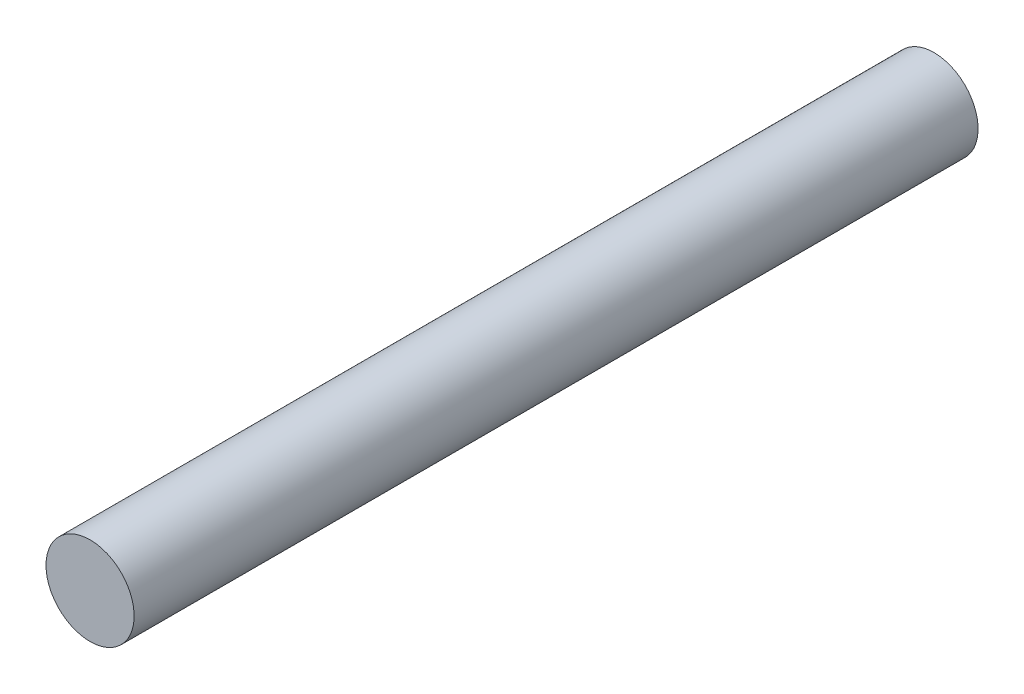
ISO-10303-21;
HEADER;
FILE_DESCRIPTION(('STEP AP214'),'2;1');
FILE_NAME('part.step','',(''),(''),'','','');
FILE_SCHEMA(('AUTOMOTIVE_DESIGN { 1 0 10303 214 1 1 1 1 }'));
ENDSEC;
DATA;
#1=APPLICATION_CONTEXT('core data for automotive mechanical design processes');
#2=APPLICATION_PROTOCOL_DEFINITION('international standard','automotive_design',2000,#1);
#3=PRODUCT_CONTEXT('',#1,'mechanical');
#4=PRODUCT('Part','Part','',(#3));
#5=PRODUCT_RELATED_PRODUCT_CATEGORY('part','',(#4));
#6=PRODUCT_DEFINITION_FORMATION('','',#4);
#7=PRODUCT_DEFINITION_CONTEXT('part definition',#1,'design');
#8=PRODUCT_DEFINITION('design','',#6,#7);
#9=PRODUCT_DEFINITION_SHAPE('','',#8);
#10=(LENGTH_UNIT() NAMED_UNIT(*) SI_UNIT(.MILLI.,.METRE.));
#11=(NAMED_UNIT(*) PLANE_ANGLE_UNIT() SI_UNIT($,.RADIAN.));
#12=(NAMED_UNIT(*) SI_UNIT($,.STERADIAN.) SOLID_ANGLE_UNIT());
#13=UNCERTAINTY_MEASURE_WITH_UNIT(LENGTH_MEASURE(1.E-05),#10,'distance_accuracy_value','');
#14=(GEOMETRIC_REPRESENTATION_CONTEXT(3) GLOBAL_UNCERTAINTY_ASSIGNED_CONTEXT((#13)) GLOBAL_UNIT_ASSIGNED_CONTEXT((#10,
#11,#12)) REPRESENTATION_CONTEXT('',''));
#15=CARTESIAN_POINT('',(0.,0.,0.));
#16=DIRECTION('',(0.,0.,1.));
#17=DIRECTION('',(1.,0.,0.));
#18=AXIS2_PLACEMENT_3D('',#15,#16,#17);
#19=CARTESIAN_POINT('',(0.,0.,30.4));
#20=DIRECTION('',(0.,0.,-1.));
#21=DIRECTION('',(-1.,0.,0.));
#22=AXIS2_PLACEMENT_3D('',#19,#20,#21);
#23=CYLINDRICAL_SURFACE('',#22,3.175);
#24=CARTESIAN_POINT('',(0.,0.,30.4));
#25=DIRECTION('',(0.,0.,1.));
#26=DIRECTION('',(1.,0.,0.));
#27=AXIS2_PLACEMENT_3D('',#24,#25,#26);
#28=CIRCLE('',#27,3.175);
#29=CARTESIAN_POINT('',(-3.175,0.,30.4));
#30=VERTEX_POINT('',#29);
#31=EDGE_CURVE('E10',#30,#30,#28,.T.);
#32=CARTESIAN_POINT('',(0.,0.,-30.4));
#33=DIRECTION('',(0.,0.,1.));
#34=DIRECTION('',(1.,0.,0.));
#35=AXIS2_PLACEMENT_3D('',#32,#33,#34);
#36=CIRCLE('',#35,3.175);
#37=CARTESIAN_POINT('',(-3.175,0.,-30.4));
#38=VERTEX_POINT('',#37);
#39=EDGE_CURVE('E33',#38,#38,#36,.T.);
#40=CARTESIAN_POINT('',(-3.175,0.,30.4));
#41=CARTESIAN_POINT('',(-3.175,0.,29.7666666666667));
#42=CARTESIAN_POINT('',(-3.175,0.,29.1333333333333));
#43=CARTESIAN_POINT('',(-3.175,0.,27.8666666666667));
#44=CARTESIAN_POINT('',(-3.175,0.,27.2333333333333));
#45=CARTESIAN_POINT('',(-3.175,0.,25.9666666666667));
#46=CARTESIAN_POINT('',(-3.175,0.,25.3333333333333));
#47=CARTESIAN_POINT('',(-3.175,0.,24.0666666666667));
#48=CARTESIAN_POINT('',(-3.175,0.,23.4333333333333));
#49=CARTESIAN_POINT('',(-3.175,0.,22.1666666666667));
#50=CARTESIAN_POINT('',(-3.175,0.,21.5333333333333));
#51=CARTESIAN_POINT('',(-3.175,0.,20.2666666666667));
#52=CARTESIAN_POINT('',(-3.175,0.,19.6333333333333));
#53=CARTESIAN_POINT('',(-3.175,0.,18.3666666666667));
#54=CARTESIAN_POINT('',(-3.175,0.,17.7333333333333));
#55=CARTESIAN_POINT('',(-3.175,0.,16.4666666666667));
#56=CARTESIAN_POINT('',(-3.175,0.,15.8333333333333));
#57=CARTESIAN_POINT('',(-3.175,0.,14.5666666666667));
#58=CARTESIAN_POINT('',(-3.175,0.,13.9333333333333));
#59=CARTESIAN_POINT('',(-3.175,0.,12.6666666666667));
#60=CARTESIAN_POINT('',(-3.175,0.,12.0333333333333));
#61=CARTESIAN_POINT('',(-3.175,0.,10.7666666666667));
#62=CARTESIAN_POINT('',(-3.175,0.,10.1333333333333));
#63=CARTESIAN_POINT('',(-3.175,0.,8.86666666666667));
#64=CARTESIAN_POINT('',(-3.175,0.,8.23333333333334));
#65=CARTESIAN_POINT('',(-3.175,0.,6.96666666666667));
#66=CARTESIAN_POINT('',(-3.175,0.,6.33333333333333));
#67=CARTESIAN_POINT('',(-3.175,0.,5.06666666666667));
#68=CARTESIAN_POINT('',(-3.175,0.,4.43333333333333));
#69=CARTESIAN_POINT('',(-3.175,0.,3.16666666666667));
#70=CARTESIAN_POINT('',(-3.175,0.,2.53333333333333));
#71=CARTESIAN_POINT('',(-3.175,0.,1.26666666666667));
#72=CARTESIAN_POINT('',(-3.175,0.,0.633333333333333));
#73=CARTESIAN_POINT('',(-3.175,0.,-0.633333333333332));
#74=CARTESIAN_POINT('',(-3.175,0.,-1.26666666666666));
#75=CARTESIAN_POINT('',(-3.175,0.,-2.53333333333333));
#76=CARTESIAN_POINT('',(-3.175,0.,-3.16666666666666));
#77=CARTESIAN_POINT('',(-3.175,0.,-4.43333333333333));
#78=CARTESIAN_POINT('',(-3.175,0.,-5.06666666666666));
#79=CARTESIAN_POINT('',(-3.175,0.,-6.33333333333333));
#80=CARTESIAN_POINT('',(-3.175,0.,-6.96666666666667));
#81=CARTESIAN_POINT('',(-3.175,0.,-8.23333333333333));
#82=CARTESIAN_POINT('',(-3.175,0.,-8.86666666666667));
#83=CARTESIAN_POINT('',(-3.175,0.,-10.1333333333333));
#84=CARTESIAN_POINT('',(-3.175,0.,-10.7666666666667));
#85=CARTESIAN_POINT('',(-3.175,0.,-12.0333333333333));
#86=CARTESIAN_POINT('',(-3.175,0.,-12.6666666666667));
#87=CARTESIAN_POINT('',(-3.175,0.,-13.9333333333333));
#88=CARTESIAN_POINT('',(-3.175,0.,-14.5666666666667));
#89=CARTESIAN_POINT('',(-3.175,0.,-15.8333333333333));
#90=CARTESIAN_POINT('',(-3.175,0.,-16.4666666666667));
#91=CARTESIAN_POINT('',(-3.175,0.,-17.7333333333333));
#92=CARTESIAN_POINT('',(-3.175,0.,-18.3666666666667));
#93=CARTESIAN_POINT('',(-3.175,0.,-19.6333333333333));
#94=CARTESIAN_POINT('',(-3.175,0.,-20.2666666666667));
#95=CARTESIAN_POINT('',(-3.175,0.,-21.5333333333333));
#96=CARTESIAN_POINT('',(-3.175,0.,-22.1666666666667));
#97=CARTESIAN_POINT('',(-3.175,0.,-23.4333333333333));
#98=CARTESIAN_POINT('',(-3.175,0.,-24.0666666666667));
#99=CARTESIAN_POINT('',(-3.175,0.,-25.3333333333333));
#100=CARTESIAN_POINT('',(-3.175,0.,-25.9666666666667));
#101=CARTESIAN_POINT('',(-3.175,0.,-27.2333333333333));
#102=CARTESIAN_POINT('',(-3.175,0.,-27.8666666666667));
#103=CARTESIAN_POINT('',(-3.175,0.,-29.1333333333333));
#104=CARTESIAN_POINT('',(-3.175,0.,-29.7666666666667));
#105=CARTESIAN_POINT('',(-3.175,0.,-30.4));
#106=B_SPLINE_CURVE_WITH_KNOTS('',3,(#40,#41,#42,#43,#44,#45,#46,#47,#48,#49,#50,#51,#52,#53,
#54,#55,#56,#57,#58,#59,#60,#61,#62,#63,#64,#65,#66,#67,#68,#69,#70,#71,#72,#73,#74,#75,#76,#77,
#78,#79,#80,#81,#82,#83,#84,#85,#86,#87,#88,#89,#90,#91,#92,#93,#94,#95,#96,#97,#98,#99,#100,
#101,#102,#103,#104,#105),.UNSPECIFIED.,.F.,.F.,(4,2,2,2,2,2,2,2,2,2,2,2,2,2,2,2,2,2,2,2,2,2,2,
2,2,2,2,2,2,2,2,2,4),(0.,1.9,3.8,5.7,7.6,9.5,11.4,13.3,15.2,17.1,19.,20.9,22.8,24.7,26.6,28.5,
30.4,32.3,34.2,36.1,38.,39.9,41.8,43.7,45.6,47.5,49.4,51.3,53.2,55.1,57.,58.9,60.8),.UNSPECIFIED.);
#107=EDGE_CURVE('BSEAM30',#30,#38,#106,.T.);
#108=ORIENTED_EDGE('',*,*,#31,.F.);
#109=ORIENTED_EDGE('',*,*,#39,.T.);
#110=ORIENTED_EDGE('',*,*,#107,.T.);
#111=ORIENTED_EDGE('',*,*,#107,.F.);
#112=EDGE_LOOP('',(#108,#110,#109,#111));
#113=FACE_BOUND('',#112,.T.);
#114=ADVANCED_FACE('F30',(#113),#23,.T.);
#115=CARTESIAN_POINT('',(0.,0.,30.4));
#116=DIRECTION('',(0.,0.,1.));
#117=DIRECTION('',(1.,0.,0.));
#118=AXIS2_PLACEMENT_3D('',#115,#116,#117);
#119=PLANE('',#118);
#120=ORIENTED_EDGE('',*,*,#31,.T.);
#121=EDGE_LOOP('',(#120));
#122=FACE_BOUND('',#121,.T.);
#123=ADVANCED_FACE('F45',(#122),#119,.T.);
#124=CARTESIAN_POINT('',(0.,0.,-30.4));
#125=DIRECTION('',(0.,0.,1.));
#126=DIRECTION('',(1.,0.,0.));
#127=AXIS2_PLACEMENT_3D('',#124,#125,#126);
#128=PLANE('',#127);
#129=ORIENTED_EDGE('',*,*,#39,.F.);
#130=EDGE_LOOP('',(#129));
#131=FACE_BOUND('',#130,.T.);
#132=ADVANCED_FACE('F43',(#131),#128,.F.);
#133=CLOSED_SHELL('',(#114,#123,#132));
#134=MANIFOLD_SOLID_BREP('B2',#133);
#135=ADVANCED_BREP_SHAPE_REPRESENTATION('',(#18,#134),#14);
#136=SHAPE_DEFINITION_REPRESENTATION(#9,#135);
ENDSEC;
END-ISO-10303-21;
